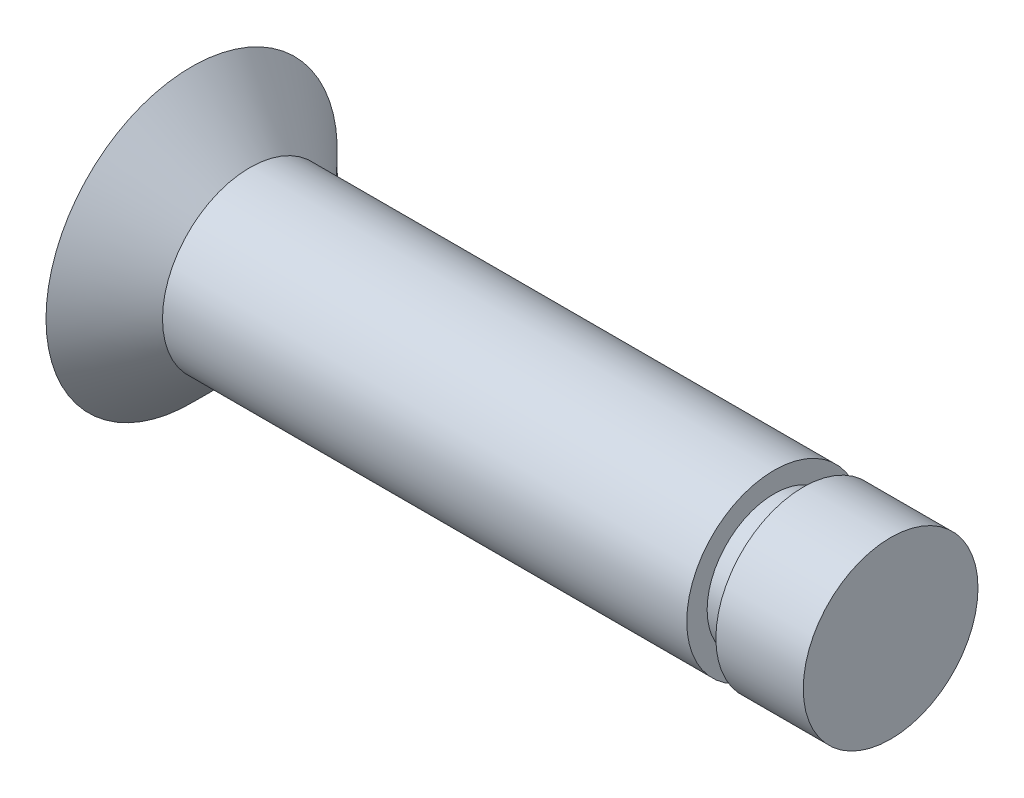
ISO-10303-21;
HEADER;
FILE_DESCRIPTION(('STEP AP214'),'2;1');
FILE_NAME('part.step','',(''),(''),'','','');
FILE_SCHEMA(('AUTOMOTIVE_DESIGN { 1 0 10303 214 1 1 1 1 }'));
ENDSEC;
DATA;
#1=APPLICATION_CONTEXT('core data for automotive mechanical design processes');
#2=APPLICATION_PROTOCOL_DEFINITION('international standard','automotive_design',2000,#1);
#3=PRODUCT_CONTEXT('',#1,'mechanical');
#4=PRODUCT('Part','Part','',(#3));
#5=PRODUCT_RELATED_PRODUCT_CATEGORY('part','',(#4));
#6=PRODUCT_DEFINITION_FORMATION('','',#4);
#7=PRODUCT_DEFINITION_CONTEXT('part definition',#1,'design');
#8=PRODUCT_DEFINITION('design','',#6,#7);
#9=PRODUCT_DEFINITION_SHAPE('','',#8);
#10=(LENGTH_UNIT() NAMED_UNIT(*) SI_UNIT(.MILLI.,.METRE.));
#11=(NAMED_UNIT(*) PLANE_ANGLE_UNIT() SI_UNIT($,.RADIAN.));
#12=(NAMED_UNIT(*) SI_UNIT($,.STERADIAN.) SOLID_ANGLE_UNIT());
#13=UNCERTAINTY_MEASURE_WITH_UNIT(LENGTH_MEASURE(1.E-05),#10,'distance_accuracy_value','');
#14=(GEOMETRIC_REPRESENTATION_CONTEXT(3) GLOBAL_UNCERTAINTY_ASSIGNED_CONTEXT((#13)) GLOBAL_UNIT_ASSIGNED_CONTEXT((#10,
#11,#12)) REPRESENTATION_CONTEXT('',''));
#15=CARTESIAN_POINT('',(0.,0.,0.));
#16=DIRECTION('',(0.,0.,1.));
#17=DIRECTION('',(1.,0.,0.));
#18=AXIS2_PLACEMENT_3D('',#15,#16,#17);
#19=CARTESIAN_POINT('',(0.,0.,0.));
#20=DIRECTION('',(1.,0.,0.));
#21=DIRECTION('',(0.,0.,-1.));
#22=AXIS2_PLACEMENT_3D('',#19,#20,#21);
#23=PLANE('',#22);
#24=CARTESIAN_POINT('',(0.,0.,0.));
#25=DIRECTION('',(-1.,0.,0.));
#26=DIRECTION('',(0.,0.,1.));
#27=AXIS2_PLACEMENT_3D('',#24,#25,#26);
#28=CIRCLE('',#27,2.5);
#29=CARTESIAN_POINT('',(0.,0.,2.5));
#30=VERTEX_POINT('',#29);
#31=EDGE_CURVE('E10',#30,#30,#28,.T.);
#32=ORIENTED_EDGE('',*,*,#31,.T.);
#33=EDGE_LOOP('',(#32));
#34=FACE_BOUND('',#33,.T.);
#35=ADVANCED_FACE('F31',(#34),#23,.F.);
#36=CARTESIAN_POINT('',(1.,0.,0.));
#37=DIRECTION('',(-1.,0.,0.));
#38=DIRECTION('',(0.,0.,1.));
#39=AXIS2_PLACEMENT_3D('',#36,#37,#38);
#40=CONICAL_SURFACE('',#39,1.5,0.785398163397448);
#41=ORIENTED_EDGE('',*,*,#31,.F.);
#42=EDGE_LOOP('',(#41));
#43=FACE_BOUND('',#42,.T.);
#44=CARTESIAN_POINT('',(1.,0.,0.));
#45=DIRECTION('',(-1.,0.,0.));
#46=DIRECTION('',(0.,0.,1.));
#47=AXIS2_PLACEMENT_3D('',#44,#45,#46);
#48=CIRCLE('',#47,1.5);
#49=CARTESIAN_POINT('',(1.,0.,1.5));
#50=VERTEX_POINT('',#49);
#51=EDGE_CURVE('E37',#50,#50,#48,.T.);
#52=ORIENTED_EDGE('',*,*,#51,.T.);
#53=EDGE_LOOP('',(#52));
#54=FACE_BOUND('',#53,.T.);
#55=ADVANCED_FACE('F72',(#43,#54),#40,.T.);
#56=CARTESIAN_POINT('',(-40.,0.,0.));
#57=DIRECTION('',(-1.,0.,0.));
#58=DIRECTION('',(0.,0.,1.));
#59=AXIS2_PLACEMENT_3D('',#56,#57,#58);
#60=CYLINDRICAL_SURFACE('',#59,1.5);
#61=ORIENTED_EDGE('',*,*,#51,.F.);
#62=EDGE_LOOP('',(#61));
#63=FACE_BOUND('',#62,.T.);
#64=CARTESIAN_POINT('',(10.,0.,0.));
#65=DIRECTION('',(-1.,0.,0.));
#66=DIRECTION('',(0.,0.,1.));
#67=AXIS2_PLACEMENT_3D('',#64,#65,#66);
#68=CIRCLE('',#67,1.5);
#69=CARTESIAN_POINT('',(10.,0.,1.5));
#70=VERTEX_POINT('',#69);
#71=EDGE_CURVE('E41',#70,#70,#68,.T.);
#72=ORIENTED_EDGE('',*,*,#71,.T.);
#73=EDGE_LOOP('',(#72));
#74=FACE_BOUND('',#73,.T.);
#75=ADVANCED_FACE('F76',(#63,#74),#60,.T.);
#76=CARTESIAN_POINT('',(10.,1.5,0.));
#77=DIRECTION('',(-1.,0.,0.));
#78=DIRECTION('',(0.,0.,1.));
#79=AXIS2_PLACEMENT_3D('',#76,#77,#78);
#80=PLANE('',#79);
#81=ORIENTED_EDGE('',*,*,#71,.F.);
#82=EDGE_LOOP('',(#81));
#83=FACE_BOUND('',#82,.T.);
#84=CARTESIAN_POINT('',(10.,0.,0.));
#85=DIRECTION('',(-1.,0.,0.));
#86=DIRECTION('',(0.,0.,1.));
#87=AXIS2_PLACEMENT_3D('',#84,#85,#86);
#88=CIRCLE('',#87,1.15);
#89=CARTESIAN_POINT('',(10.,0.,1.15));
#90=VERTEX_POINT('',#89);
#91=EDGE_CURVE('E45',#90,#90,#88,.T.);
#92=ORIENTED_EDGE('',*,*,#91,.T.);
#93=EDGE_LOOP('',(#92));
#94=FACE_BOUND('',#93,.T.);
#95=ADVANCED_FACE('F81',(#83,#94),#80,.F.);
#96=CARTESIAN_POINT('',(-40.,0.,0.));
#97=DIRECTION('',(-1.,0.,0.));
#98=DIRECTION('',(0.,0.,1.));
#99=AXIS2_PLACEMENT_3D('',#96,#97,#98);
#100=CYLINDRICAL_SURFACE('',#99,1.15);
#101=ORIENTED_EDGE('',*,*,#91,.F.);
#102=EDGE_LOOP('',(#101));
#103=FACE_BOUND('',#102,.T.);
#104=CARTESIAN_POINT('',(10.5,0.,0.));
#105=DIRECTION('',(-1.,0.,0.));
#106=DIRECTION('',(0.,0.,1.));
#107=AXIS2_PLACEMENT_3D('',#104,#105,#106);
#108=CIRCLE('',#107,1.15);
#109=CARTESIAN_POINT('',(10.5,0.,1.15));
#110=VERTEX_POINT('',#109);
#111=EDGE_CURVE('E50',#110,#110,#108,.T.);
#112=ORIENTED_EDGE('',*,*,#111,.T.);
#113=EDGE_LOOP('',(#112));
#114=FACE_BOUND('',#113,.T.);
#115=ADVANCED_FACE('F87',(#103,#114),#100,.T.);
#116=CARTESIAN_POINT('',(10.5,1.15,0.));
#117=DIRECTION('',(1.,0.,0.));
#118=DIRECTION('',(0.,0.,-1.));
#119=AXIS2_PLACEMENT_3D('',#116,#117,#118);
#120=PLANE('',#119);
#121=ORIENTED_EDGE('',*,*,#111,.F.);
#122=EDGE_LOOP('',(#121));
#123=FACE_BOUND('',#122,.T.);
#124=CARTESIAN_POINT('',(10.5,0.,0.));
#125=DIRECTION('',(-1.,0.,0.));
#126=DIRECTION('',(0.,0.,1.));
#127=AXIS2_PLACEMENT_3D('',#124,#125,#126);
#128=CIRCLE('',#127,1.5);
#129=CARTESIAN_POINT('',(10.5,0.,1.5));
#130=VERTEX_POINT('',#129);
#131=EDGE_CURVE('E53',#130,#130,#128,.T.);
#132=ORIENTED_EDGE('',*,*,#131,.T.);
#133=EDGE_LOOP('',(#132));
#134=FACE_BOUND('',#133,.T.);
#135=ADVANCED_FACE('F68',(#123,#134),#120,.F.);
#136=CARTESIAN_POINT('',(-40.,0.,0.));
#137=DIRECTION('',(-1.,0.,0.));
#138=DIRECTION('',(0.,0.,1.));
#139=AXIS2_PLACEMENT_3D('',#136,#137,#138);
#140=CYLINDRICAL_SURFACE('',#139,1.5);
#141=ORIENTED_EDGE('',*,*,#131,.F.);
#142=EDGE_LOOP('',(#141));
#143=FACE_BOUND('',#142,.T.);
#144=CARTESIAN_POINT('',(12.,0.,0.));
#145=DIRECTION('',(-1.,0.,0.));
#146=DIRECTION('',(0.,0.,1.));
#147=AXIS2_PLACEMENT_3D('',#144,#145,#146);
#148=CIRCLE('',#147,1.5);
#149=CARTESIAN_POINT('',(12.,0.,1.5));
#150=VERTEX_POINT('',#149);
#151=EDGE_CURVE('E56',#150,#150,#148,.T.);
#152=ORIENTED_EDGE('',*,*,#151,.T.);
#153=EDGE_LOOP('',(#152));
#154=FACE_BOUND('',#153,.T.);
#155=ADVANCED_FACE('F60',(#143,#154),#140,.T.);
#156=CARTESIAN_POINT('',(12.,1.5,0.));
#157=DIRECTION('',(-1.,0.,0.));
#158=DIRECTION('',(0.,0.,1.));
#159=AXIS2_PLACEMENT_3D('',#156,#157,#158);
#160=PLANE('',#159);
#161=ORIENTED_EDGE('',*,*,#151,.F.);
#162=EDGE_LOOP('',(#161));
#163=FACE_BOUND('',#162,.T.);
#164=ADVANCED_FACE('F62',(#163),#160,.F.);
#165=CLOSED_SHELL('',(#35,#55,#75,#95,#115,#135,#155,#164));
#166=MANIFOLD_SOLID_BREP('B2',#165);
#167=ADVANCED_BREP_SHAPE_REPRESENTATION('',(#18,#166),#14);
#168=SHAPE_DEFINITION_REPRESENTATION(#9,#167);
ENDSEC;
END-ISO-10303-21;
